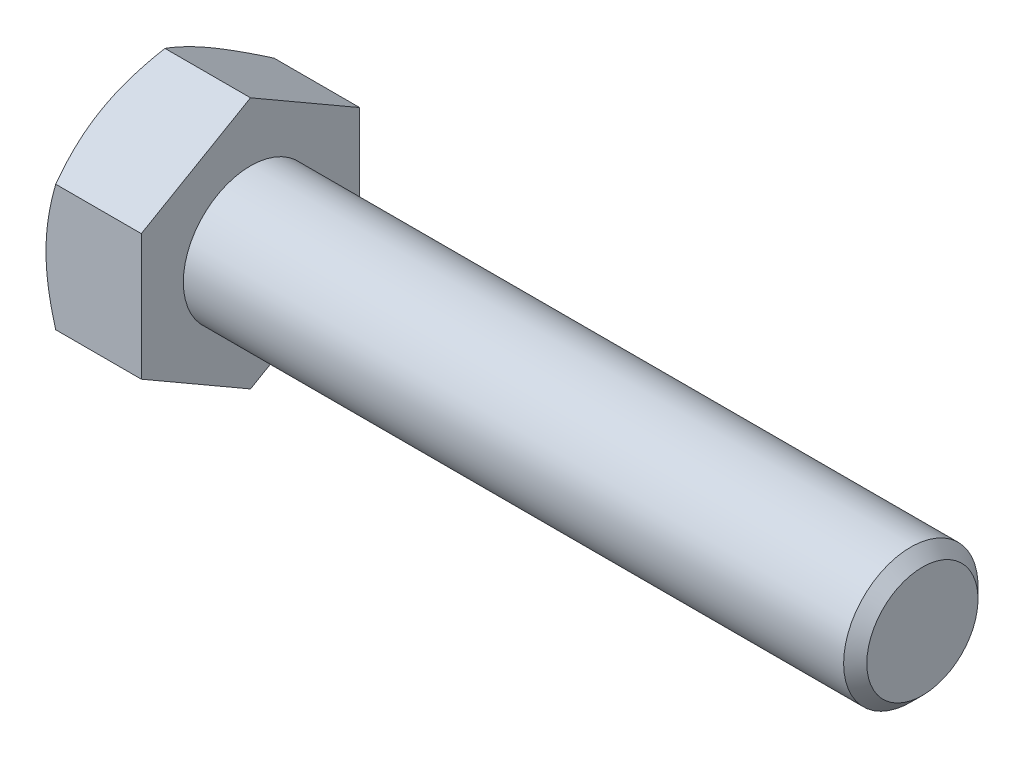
from build123d import *

# Parameters (mm, degrees)
BASEHEAD_DEPTH = 5.675


with BuildPart() as part:
    # Sketch1 → BaseHead (new body)
    with BuildSketch(Plane(origin=(0, 0, 0), x_dir=(0, 0, -1), z_dir=(1, 0, 0))):
        Polygon((6.5, 3.75277675), (6.5, -3.75277675), (0, -7.505553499), (-6.5, -3.75277675), (-6.5, 3.75277675), (0, 7.505553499), align=None)
    extrude(amount=BASEHEAD_DEPTH)

    # BodySke → BaseBody (revolve)
    with BuildSketch(Plane.XY, mode=Mode.PRIVATE) as basebody_sk:
        Polygon((0, 0), (45.675, 0), (45.675, 3.3095), (44.9845, 4), (0, 4), align=None)
    revolve(basebody_sk.sketch.rotate(Axis((0, 0, 0), (1, 0, 0)), 90), axis=Axis((0, 0, 0), (1, 0, 0)))

    # Sketch3 → HeadChamfer (revolve, cut)
    with BuildSketch(Plane.XY):
        Polygon((0, 6.5), (3.46730793, 12.505553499), (3.46730793, 17.505553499), (-10, 17.505553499), (-10, 6.5), align=None)
    revolve(axis=Axis((0, 0, 0), (1, 0, 0)), mode=Mode.SUBTRACT)


solid = part.part
